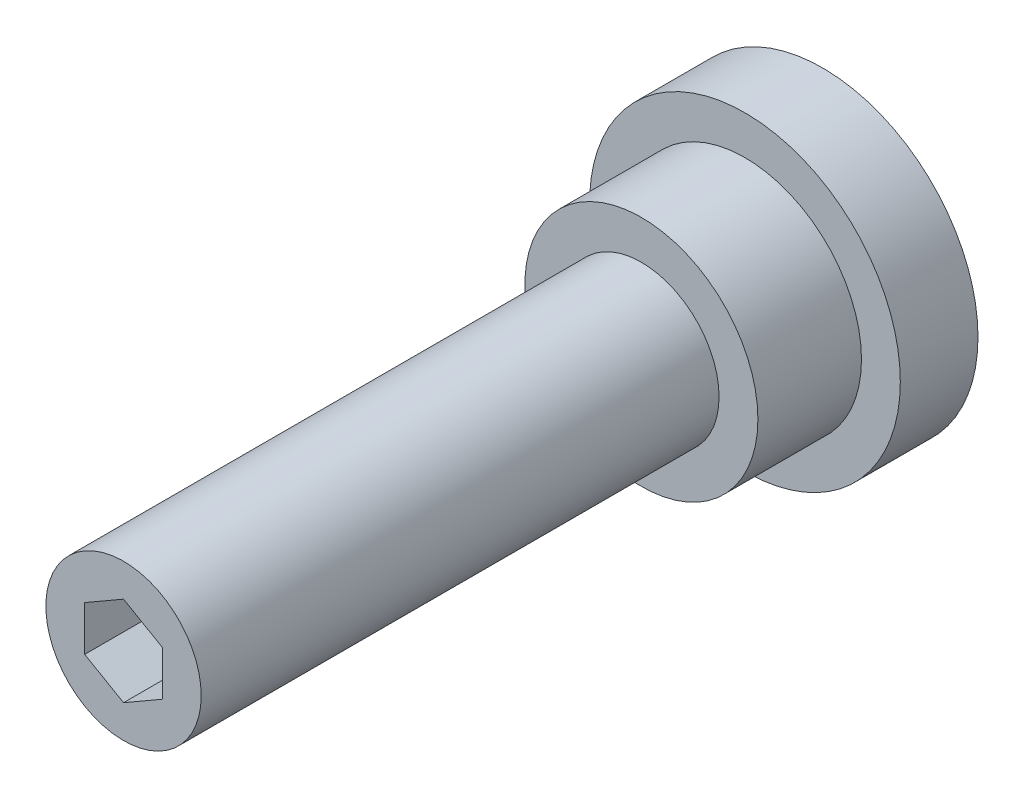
ISO-10303-21;
HEADER;
FILE_DESCRIPTION(('STEP AP214'),'2;1');
FILE_NAME('part.step','',(''),(''),'','','');
FILE_SCHEMA(('AUTOMOTIVE_DESIGN { 1 0 10303 214 1 1 1 1 }'));
ENDSEC;
DATA;
#1=APPLICATION_CONTEXT('core data for automotive mechanical design processes');
#2=APPLICATION_PROTOCOL_DEFINITION('international standard','automotive_design',2000,#1);
#3=PRODUCT_CONTEXT('',#1,'mechanical');
#4=PRODUCT('Part','Part','',(#3));
#5=PRODUCT_RELATED_PRODUCT_CATEGORY('part','',(#4));
#6=PRODUCT_DEFINITION_FORMATION('','',#4);
#7=PRODUCT_DEFINITION_CONTEXT('part definition',#1,'design');
#8=PRODUCT_DEFINITION('design','',#6,#7);
#9=PRODUCT_DEFINITION_SHAPE('','',#8);
#10=(LENGTH_UNIT() NAMED_UNIT(*) SI_UNIT(.MILLI.,.METRE.));
#11=(NAMED_UNIT(*) PLANE_ANGLE_UNIT() SI_UNIT($,.RADIAN.));
#12=(NAMED_UNIT(*) SI_UNIT($,.STERADIAN.) SOLID_ANGLE_UNIT());
#13=UNCERTAINTY_MEASURE_WITH_UNIT(LENGTH_MEASURE(1.E-05),#10,'distance_accuracy_value','');
#14=(GEOMETRIC_REPRESENTATION_CONTEXT(3) GLOBAL_UNCERTAINTY_ASSIGNED_CONTEXT((#13)) GLOBAL_UNIT_ASSIGNED_CONTEXT((#10,
#11,#12)) REPRESENTATION_CONTEXT('',''));
#15=CARTESIAN_POINT('',(0.,0.,0.));
#16=DIRECTION('',(0.,0.,1.));
#17=DIRECTION('',(1.,0.,0.));
#18=AXIS2_PLACEMENT_3D('',#15,#16,#17);
#19=CARTESIAN_POINT('',(-6.,0.,0.));
#20=DIRECTION('',(0.,0.,-1.));
#21=DIRECTION('',(-1.,0.,0.));
#22=AXIS2_PLACEMENT_3D('',#19,#20,#21);
#23=PLANE('',#22);
#24=CARTESIAN_POINT('',(0.,0.,0.));
#25=DIRECTION('',(0.,0.,1.));
#26=DIRECTION('',(1.,0.,0.));
#27=AXIS2_PLACEMENT_3D('',#24,#25,#26);
#28=CIRCLE('',#27,6.);
#29=CARTESIAN_POINT('',(6.,0.,0.));
#30=VERTEX_POINT('',#29);
#31=EDGE_CURVE('E9',#30,#30,#28,.T.);
#32=ORIENTED_EDGE('',*,*,#31,.F.);
#33=EDGE_LOOP('',(#32));
#34=FACE_BOUND('',#33,.T.);
#35=ADVANCED_FACE('F14',(#34),#23,.T.);
#36=CARTESIAN_POINT('',(0.,0.,30.));
#37=DIRECTION('',(0.,0.,1.));
#38=DIRECTION('',(1.,0.,0.));
#39=AXIS2_PLACEMENT_3D('',#36,#37,#38);
#40=CYLINDRICAL_SURFACE('',#39,6.);
#41=ORIENTED_EDGE('',*,*,#31,.T.);
#42=EDGE_LOOP('',(#41));
#43=FACE_BOUND('',#42,.T.);
#44=CARTESIAN_POINT('',(0.,0.,3.));
#45=DIRECTION('',(0.,0.,1.));
#46=DIRECTION('',(1.,0.,0.));
#47=AXIS2_PLACEMENT_3D('',#44,#45,#46);
#48=CIRCLE('',#47,6.);
#49=CARTESIAN_POINT('',(6.,0.,3.));
#50=VERTEX_POINT('',#49);
#51=EDGE_CURVE('E21',#50,#50,#48,.T.);
#52=ORIENTED_EDGE('',*,*,#51,.F.);
#53=EDGE_LOOP('',(#52));
#54=FACE_BOUND('',#53,.T.);
#55=ADVANCED_FACE('F137',(#43,#54),#40,.T.);
#56=CARTESIAN_POINT('',(-4.5,0.,3.));
#57=DIRECTION('',(0.,0.,1.));
#58=DIRECTION('',(1.,0.,0.));
#59=AXIS2_PLACEMENT_3D('',#56,#57,#58);
#60=PLANE('',#59);
#61=ORIENTED_EDGE('',*,*,#51,.T.);
#62=EDGE_LOOP('',(#61));
#63=FACE_BOUND('',#62,.T.);
#64=CARTESIAN_POINT('',(0.,0.,3.));
#65=DIRECTION('',(0.,0.,1.));
#66=DIRECTION('',(1.,0.,0.));
#67=AXIS2_PLACEMENT_3D('',#64,#65,#66);
#68=CIRCLE('',#67,4.5);
#69=CARTESIAN_POINT('',(4.5,0.,3.));
#70=VERTEX_POINT('',#69);
#71=EDGE_CURVE('E129',#70,#70,#68,.T.);
#72=ORIENTED_EDGE('',*,*,#71,.F.);
#73=EDGE_LOOP('',(#72));
#74=FACE_BOUND('',#73,.T.);
#75=ADVANCED_FACE('F134',(#63,#74),#60,.T.);
#76=CARTESIAN_POINT('',(0.,0.,30.));
#77=DIRECTION('',(0.,0.,1.));
#78=DIRECTION('',(1.,0.,0.));
#79=AXIS2_PLACEMENT_3D('',#76,#77,#78);
#80=CYLINDRICAL_SURFACE('',#79,4.5);
#81=ORIENTED_EDGE('',*,*,#71,.T.);
#82=EDGE_LOOP('',(#81));
#83=FACE_BOUND('',#82,.T.);
#84=CARTESIAN_POINT('',(0.,0.,7.));
#85=DIRECTION('',(0.,0.,1.));
#86=DIRECTION('',(1.,0.,0.));
#87=AXIS2_PLACEMENT_3D('',#84,#85,#86);
#88=CIRCLE('',#87,4.5);
#89=CARTESIAN_POINT('',(4.5,0.,7.));
#90=VERTEX_POINT('',#89);
#91=EDGE_CURVE('E126',#90,#90,#88,.T.);
#92=ORIENTED_EDGE('',*,*,#91,.F.);
#93=EDGE_LOOP('',(#92));
#94=FACE_BOUND('',#93,.T.);
#95=ADVANCED_FACE('F145',(#83,#94),#80,.T.);
#96=CARTESIAN_POINT('',(-3.,0.,7.));
#97=DIRECTION('',(0.,0.,1.));
#98=DIRECTION('',(1.,0.,0.));
#99=AXIS2_PLACEMENT_3D('',#96,#97,#98);
#100=PLANE('',#99);
#101=ORIENTED_EDGE('',*,*,#91,.T.);
#102=EDGE_LOOP('',(#101));
#103=FACE_BOUND('',#102,.T.);
#104=CARTESIAN_POINT('',(0.,0.,7.));
#105=DIRECTION('',(0.,0.,1.));
#106=DIRECTION('',(1.,0.,0.));
#107=AXIS2_PLACEMENT_3D('',#104,#105,#106);
#108=CIRCLE('',#107,3.);
#109=CARTESIAN_POINT('',(3.,0.,7.));
#110=VERTEX_POINT('',#109);
#111=EDGE_CURVE('E123',#110,#110,#108,.T.);
#112=ORIENTED_EDGE('',*,*,#111,.F.);
#113=EDGE_LOOP('',(#112));
#114=FACE_BOUND('',#113,.T.);
#115=ADVANCED_FACE('F151',(#103,#114),#100,.T.);
#116=CARTESIAN_POINT('',(0.,0.,30.));
#117=DIRECTION('',(0.,0.,1.));
#118=DIRECTION('',(1.,0.,0.));
#119=AXIS2_PLACEMENT_3D('',#116,#117,#118);
#120=CYLINDRICAL_SURFACE('',#119,3.);
#121=ORIENTED_EDGE('',*,*,#111,.T.);
#122=EDGE_LOOP('',(#121));
#123=FACE_BOUND('',#122,.T.);
#124=CARTESIAN_POINT('',(0.,0.,27.));
#125=DIRECTION('',(0.,0.,1.));
#126=DIRECTION('',(1.,0.,0.));
#127=AXIS2_PLACEMENT_3D('',#124,#125,#126);
#128=CIRCLE('',#127,3.);
#129=CARTESIAN_POINT('',(3.,0.,27.));
#130=VERTEX_POINT('',#129);
#131=EDGE_CURVE('E115',#130,#130,#128,.T.);
#132=ORIENTED_EDGE('',*,*,#131,.F.);
#133=EDGE_LOOP('',(#132));
#134=FACE_BOUND('',#133,.T.);
#135=ADVANCED_FACE('F155',(#123,#134),#120,.T.);
#136=CARTESIAN_POINT('',(0.,0.,27.));
#137=DIRECTION('',(0.,0.,1.));
#138=DIRECTION('',(1.,0.,0.));
#139=AXIS2_PLACEMENT_3D('',#136,#137,#138);
#140=PLANE('',#139);
#141=DIRECTION('',(-0.866025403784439,0.5,0.));
#142=VECTOR('',#141,1.);
#143=CARTESIAN_POINT('',(1.5,0.86602540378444,27.));
#144=LINE('',#143,#142);
#145=CARTESIAN_POINT('',(1.5,0.86602540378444,27.));
#146=VERTEX_POINT('',#145);
#147=CARTESIAN_POINT('',(0.,1.73205080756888,27.));
#148=VERTEX_POINT('',#147);
#149=EDGE_CURVE('E28',#146,#148,#144,.T.);
#150=ORIENTED_EDGE('',*,*,#149,.F.);
#151=DIRECTION('',(0.,1.,0.));
#152=VECTOR('',#151,1.);
#153=CARTESIAN_POINT('',(1.5,-0.866025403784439,27.));
#154=LINE('',#153,#152);
#155=CARTESIAN_POINT('',(1.5,-0.866025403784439,27.));
#156=VERTEX_POINT('',#155);
#157=EDGE_CURVE('E111',#156,#146,#154,.T.);
#158=ORIENTED_EDGE('',*,*,#157,.F.);
#159=DIRECTION('',(0.866025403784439,0.5,0.));
#160=VECTOR('',#159,1.);
#161=CARTESIAN_POINT('',(0.,-1.73205080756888,27.));
#162=LINE('',#161,#160);
#163=CARTESIAN_POINT('',(0.,-1.73205080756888,27.));
#164=VERTEX_POINT('',#163);
#165=EDGE_CURVE('E109',#164,#156,#162,.T.);
#166=ORIENTED_EDGE('',*,*,#165,.F.);
#167=DIRECTION('',(0.866025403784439,-0.5,0.));
#168=VECTOR('',#167,1.);
#169=CARTESIAN_POINT('',(-1.5,-0.866025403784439,27.));
#170=LINE('',#169,#168);
#171=CARTESIAN_POINT('',(-1.5,-0.866025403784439,27.));
#172=VERTEX_POINT('',#171);
#173=EDGE_CURVE('E76',#172,#164,#170,.T.);
#174=ORIENTED_EDGE('',*,*,#173,.F.);
#175=DIRECTION('',(0.,-1.,0.));
#176=VECTOR('',#175,1.);
#177=CARTESIAN_POINT('',(-1.5,0.866025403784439,27.));
#178=LINE('',#177,#176);
#179=CARTESIAN_POINT('',(-1.5,0.866025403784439,27.));
#180=VERTEX_POINT('',#179);
#181=EDGE_CURVE('E105',#180,#172,#178,.T.);
#182=ORIENTED_EDGE('',*,*,#181,.F.);
#183=DIRECTION('',(-0.866025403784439,-0.5,0.));
#184=VECTOR('',#183,1.);
#185=CARTESIAN_POINT('',(0.,1.73205080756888,27.));
#186=LINE('',#185,#184);
#187=EDGE_CURVE('E102',#148,#180,#186,.T.);
#188=ORIENTED_EDGE('',*,*,#187,.F.);
#189=EDGE_LOOP('',(#150,#158,#166,#174,#182,#188));
#190=FACE_BOUND('',#189,.T.);
#191=ORIENTED_EDGE('',*,*,#131,.T.);
#192=EDGE_LOOP('',(#191));
#193=FACE_BOUND('',#192,.T.);
#194=ADVANCED_FACE('F159',(#190,#193),#140,.T.);
#195=CARTESIAN_POINT('',(1.5,0.86602540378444,24.));
#196=DIRECTION('',(0.5,0.866025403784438,0.));
#197=DIRECTION('',(-0.866025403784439,0.5,0.));
#198=AXIS2_PLACEMENT_3D('',#195,#196,#197);
#199=PLANE('',#198);
#200=ORIENTED_EDGE('',*,*,#149,.T.);
#201=DIRECTION('',(0.,0.,1.));
#202=VECTOR('',#201,1.);
#203=CARTESIAN_POINT('',(0.,1.73205080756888,24.));
#204=LINE('',#203,#202);
#205=CARTESIAN_POINT('',(0.,1.73205080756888,24.));
#206=VERTEX_POINT('',#205);
#207=EDGE_CURVE('E58',#206,#148,#204,.T.);
#208=ORIENTED_EDGE('',*,*,#207,.F.);
#209=DIRECTION('',(-0.866025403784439,0.5,0.));
#210=VECTOR('',#209,1.);
#211=CARTESIAN_POINT('',(1.5,0.86602540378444,24.));
#212=LINE('',#211,#210);
#213=CARTESIAN_POINT('',(1.5,0.86602540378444,24.));
#214=VERTEX_POINT('',#213);
#215=EDGE_CURVE('E113',#214,#206,#212,.T.);
#216=ORIENTED_EDGE('',*,*,#215,.F.);
#217=DIRECTION('',(0.,0.,1.));
#218=VECTOR('',#217,1.);
#219=CARTESIAN_POINT('',(1.5,0.86602540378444,24.));
#220=LINE('',#219,#218);
#221=EDGE_CURVE('E36',#214,#146,#220,.T.);
#222=ORIENTED_EDGE('',*,*,#221,.T.);
#223=EDGE_LOOP('',(#200,#208,#216,#222));
#224=FACE_BOUND('',#223,.T.);
#225=ADVANCED_FACE('F163',(#224),#199,.F.);
#226=CARTESIAN_POINT('',(1.5,-0.866025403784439,24.));
#227=DIRECTION('',(1.,0.,0.));
#228=DIRECTION('',(0.,0.,-1.));
#229=AXIS2_PLACEMENT_3D('',#226,#227,#228);
#230=PLANE('',#229);
#231=ORIENTED_EDGE('',*,*,#157,.T.);
#232=ORIENTED_EDGE('',*,*,#221,.F.);
#233=DIRECTION('',(0.,1.,0.));
#234=VECTOR('',#233,1.);
#235=CARTESIAN_POINT('',(1.5,-0.866025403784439,24.));
#236=LINE('',#235,#234);
#237=CARTESIAN_POINT('',(1.5,-0.866025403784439,24.));
#238=VERTEX_POINT('',#237);
#239=EDGE_CURVE('E88',#238,#214,#236,.T.);
#240=ORIENTED_EDGE('',*,*,#239,.F.);
#241=DIRECTION('',(0.,0.,1.));
#242=VECTOR('',#241,1.);
#243=CARTESIAN_POINT('',(1.5,-0.866025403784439,24.));
#244=LINE('',#243,#242);
#245=EDGE_CURVE('E80',#238,#156,#244,.T.);
#246=ORIENTED_EDGE('',*,*,#245,.T.);
#247=EDGE_LOOP('',(#231,#232,#240,#246));
#248=FACE_BOUND('',#247,.T.);
#249=ADVANCED_FACE('F167',(#248),#230,.F.);
#250=CARTESIAN_POINT('',(0.,-1.73205080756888,24.));
#251=DIRECTION('',(0.5,-0.866025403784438,0.));
#252=DIRECTION('',(0.866025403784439,0.5,0.));
#253=AXIS2_PLACEMENT_3D('',#250,#251,#252);
#254=PLANE('',#253);
#255=ORIENTED_EDGE('',*,*,#165,.T.);
#256=ORIENTED_EDGE('',*,*,#245,.F.);
#257=DIRECTION('',(0.866025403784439,0.5,0.));
#258=VECTOR('',#257,1.);
#259=CARTESIAN_POINT('',(0.,-1.73205080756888,24.));
#260=LINE('',#259,#258);
#261=CARTESIAN_POINT('',(0.,-1.73205080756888,24.));
#262=VERTEX_POINT('',#261);
#263=EDGE_CURVE('E84',#262,#238,#260,.T.);
#264=ORIENTED_EDGE('',*,*,#263,.F.);
#265=DIRECTION('',(0.,0.,1.));
#266=VECTOR('',#265,1.);
#267=CARTESIAN_POINT('',(0.,-1.73205080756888,24.));
#268=LINE('',#267,#266);
#269=EDGE_CURVE('E69',#262,#164,#268,.T.);
#270=ORIENTED_EDGE('',*,*,#269,.T.);
#271=EDGE_LOOP('',(#255,#256,#264,#270));
#272=FACE_BOUND('',#271,.T.);
#273=ADVANCED_FACE('F85',(#272),#254,.F.);
#274=CARTESIAN_POINT('',(-1.5,-0.866025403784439,24.));
#275=DIRECTION('',(-0.5,-0.866025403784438,0.));
#276=DIRECTION('',(0.866025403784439,-0.5,0.));
#277=AXIS2_PLACEMENT_3D('',#274,#275,#276);
#278=PLANE('',#277);
#279=ORIENTED_EDGE('',*,*,#173,.T.);
#280=ORIENTED_EDGE('',*,*,#269,.F.);
#281=DIRECTION('',(0.866025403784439,-0.5,0.));
#282=VECTOR('',#281,1.);
#283=CARTESIAN_POINT('',(-1.5,-0.866025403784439,24.));
#284=LINE('',#283,#282);
#285=CARTESIAN_POINT('',(-1.5,-0.866025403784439,24.));
#286=VERTEX_POINT('',#285);
#287=EDGE_CURVE('E73',#286,#262,#284,.T.);
#288=ORIENTED_EDGE('',*,*,#287,.F.);
#289=DIRECTION('',(0.,0.,1.));
#290=VECTOR('',#289,1.);
#291=CARTESIAN_POINT('',(-1.5,-0.866025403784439,24.));
#292=LINE('',#291,#290);
#293=EDGE_CURVE('E81',#286,#172,#292,.T.);
#294=ORIENTED_EDGE('',*,*,#293,.T.);
#295=EDGE_LOOP('',(#279,#280,#288,#294));
#296=FACE_BOUND('',#295,.T.);
#297=ADVANCED_FACE('F71',(#296),#278,.F.);
#298=CARTESIAN_POINT('',(-1.5,0.866025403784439,24.));
#299=DIRECTION('',(-1.,0.,0.));
#300=DIRECTION('',(0.,-1.,0.));
#301=AXIS2_PLACEMENT_3D('',#298,#299,#300);
#302=PLANE('',#301);
#303=ORIENTED_EDGE('',*,*,#181,.T.);
#304=ORIENTED_EDGE('',*,*,#293,.F.);
#305=DIRECTION('',(0.,-1.,0.));
#306=VECTOR('',#305,1.);
#307=CARTESIAN_POINT('',(-1.5,0.866025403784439,24.));
#308=LINE('',#307,#306);
#309=CARTESIAN_POINT('',(-1.5,0.866025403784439,24.));
#310=VERTEX_POINT('',#309);
#311=EDGE_CURVE('E94',#310,#286,#308,.T.);
#312=ORIENTED_EDGE('',*,*,#311,.F.);
#313=DIRECTION('',(0.,0.,1.));
#314=VECTOR('',#313,1.);
#315=CARTESIAN_POINT('',(-1.5,0.866025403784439,24.));
#316=LINE('',#315,#314);
#317=EDGE_CURVE('E118',#310,#180,#316,.T.);
#318=ORIENTED_EDGE('',*,*,#317,.T.);
#319=EDGE_LOOP('',(#303,#304,#312,#318));
#320=FACE_BOUND('',#319,.T.);
#321=ADVANCED_FACE('F171',(#320),#302,.F.);
#322=CARTESIAN_POINT('',(0.,1.73205080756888,24.));
#323=DIRECTION('',(-0.5,0.866025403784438,0.));
#324=DIRECTION('',(-0.866025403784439,-0.5,0.));
#325=AXIS2_PLACEMENT_3D('',#322,#323,#324);
#326=PLANE('',#325);
#327=ORIENTED_EDGE('',*,*,#187,.T.);
#328=ORIENTED_EDGE('',*,*,#317,.F.);
#329=DIRECTION('',(-0.866025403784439,-0.5,0.));
#330=VECTOR('',#329,1.);
#331=CARTESIAN_POINT('',(0.,1.73205080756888,24.));
#332=LINE('',#331,#330);
#333=EDGE_CURVE('E96',#206,#310,#332,.T.);
#334=ORIENTED_EDGE('',*,*,#333,.F.);
#335=ORIENTED_EDGE('',*,*,#207,.T.);
#336=EDGE_LOOP('',(#327,#328,#334,#335));
#337=FACE_BOUND('',#336,.T.);
#338=ADVANCED_FACE('F168',(#337),#326,.F.);
#339=CARTESIAN_POINT('',(0.,1.73205080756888,24.));
#340=DIRECTION('',(0.,0.,1.));
#341=DIRECTION('',(1.,0.,0.));
#342=AXIS2_PLACEMENT_3D('',#339,#340,#341);
#343=PLANE('',#342);
#344=ORIENTED_EDGE('',*,*,#215,.T.);
#345=ORIENTED_EDGE('',*,*,#333,.T.);
#346=ORIENTED_EDGE('',*,*,#311,.T.);
#347=ORIENTED_EDGE('',*,*,#287,.T.);
#348=ORIENTED_EDGE('',*,*,#263,.T.);
#349=ORIENTED_EDGE('',*,*,#239,.T.);
#350=EDGE_LOOP('',(#344,#345,#346,#347,#348,#349));
#351=FACE_BOUND('',#350,.T.);
#352=ADVANCED_FACE('F91',(#351),#343,.T.);
#353=CLOSED_SHELL('',(#35,#55,#75,#95,#115,#135,#194,#225,#249,#273,#297,#321,#338,#352));
#354=MANIFOLD_SOLID_BREP('B1',#353);
#355=ADVANCED_BREP_SHAPE_REPRESENTATION('',(#18,#354),#14);
#356=SHAPE_DEFINITION_REPRESENTATION(#9,#355);
ENDSEC;
END-ISO-10303-21;
